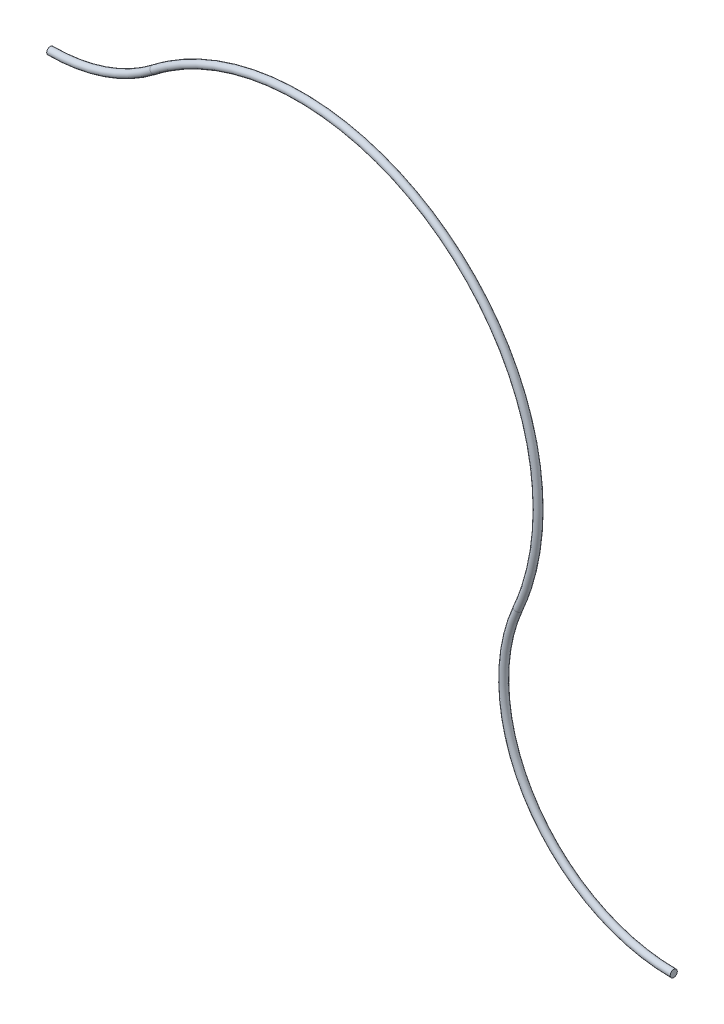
ISO-10303-21;
HEADER;
FILE_DESCRIPTION(('STEP AP214'),'2;1');
FILE_NAME('part.step','',(''),(''),'','','');
FILE_SCHEMA(('AUTOMOTIVE_DESIGN { 1 0 10303 214 1 1 1 1 }'));
ENDSEC;
DATA;
#1=APPLICATION_CONTEXT('core data for automotive mechanical design processes');
#2=APPLICATION_PROTOCOL_DEFINITION('international standard','automotive_design',2000,#1);
#3=PRODUCT_CONTEXT('',#1,'mechanical');
#4=PRODUCT('Part','Part','',(#3));
#5=PRODUCT_RELATED_PRODUCT_CATEGORY('part','',(#4));
#6=PRODUCT_DEFINITION_FORMATION('','',#4);
#7=PRODUCT_DEFINITION_CONTEXT('part definition',#1,'design');
#8=PRODUCT_DEFINITION('design','',#6,#7);
#9=PRODUCT_DEFINITION_SHAPE('','',#8);
#10=(LENGTH_UNIT() NAMED_UNIT(*) SI_UNIT(.MILLI.,.METRE.));
#11=(NAMED_UNIT(*) PLANE_ANGLE_UNIT() SI_UNIT($,.RADIAN.));
#12=(NAMED_UNIT(*) SI_UNIT($,.STERADIAN.) SOLID_ANGLE_UNIT());
#13=UNCERTAINTY_MEASURE_WITH_UNIT(LENGTH_MEASURE(1.E-05),#10,'distance_accuracy_value','');
#14=(GEOMETRIC_REPRESENTATION_CONTEXT(3) GLOBAL_UNCERTAINTY_ASSIGNED_CONTEXT((#13)) GLOBAL_UNIT_ASSIGNED_CONTEXT((#10,
#11,#12)) REPRESENTATION_CONTEXT('',''));
#15=CARTESIAN_POINT('',(0.,0.,0.));
#16=DIRECTION('',(0.,0.,1.));
#17=DIRECTION('',(1.,0.,0.));
#18=AXIS2_PLACEMENT_3D('',#15,#16,#17);
#19=CARTESIAN_POINT('',(2.794,-1.4224,0.));
#20=DIRECTION('',(0.,0.,1.));
#21=DIRECTION('',(1.,0.,0.));
#22=AXIS2_PLACEMENT_3D('',#19,#20,#21);
#23=TOROIDAL_SURFACE('',#22,0.762,0.015875);
#24=CARTESIAN_POINT('',(2.09616051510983,-1.1163541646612,0.));
#25=DIRECTION('',(-0.401634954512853,-0.915799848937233,0.));
#26=DIRECTION('',(0.,0.,-1.));
#27=AXIS2_PLACEMENT_3D('',#24,#25,#26);
#28=CIRCLE('',#27,0.015875);
#29=CARTESIAN_POINT('',(2.08162219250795,-1.10997820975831,0.));
#30=VERTEX_POINT('',#29);
#31=EDGE_CURVE('E37',#30,#30,#28,.T.);
#32=CARTESIAN_POINT('',(2.794,-2.1844,0.));
#33=DIRECTION('',(1.,0.,0.));
#34=DIRECTION('',(0.,0.,-1.));
#35=AXIS2_PLACEMENT_3D('',#32,#33,#34);
#36=CIRCLE('',#35,0.015875);
#37=CARTESIAN_POINT('',(2.794,-2.200275,0.));
#38=VERTEX_POINT('',#37);
#39=EDGE_CURVE('E10',#38,#38,#36,.T.);
#40=CARTESIAN_POINT('',(2.794,-1.4224,0.));
#41=DIRECTION('',(0.,0.,1.));
#42=DIRECTION('',(1.,0.,0.));
#43=AXIS2_PLACEMENT_3D('',#40,#41,#42);
#44=CIRCLE('',#43,0.777875);
#45=EDGE_CURVE('',#30,#38,#44,.T.);
#46=ORIENTED_EDGE('',*,*,#31,.T.);
#47=ORIENTED_EDGE('',*,*,#39,.F.);
#48=ORIENTED_EDGE('',*,*,#45,.T.);
#49=ORIENTED_EDGE('',*,*,#45,.F.);
#50=EDGE_LOOP('',(#46,#48,#47,#49));
#51=FACE_BOUND('',#50,.T.);
#52=ADVANCED_FACE('F31',(#51),#23,.T.);
#53=CARTESIAN_POINT('',(1.11781967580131,-0.687291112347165,0.));
#54=DIRECTION('',(0.,0.,-1.));
#55=DIRECTION('',(-1.,0.,0.));
#56=AXIS2_PLACEMENT_3D('',#53,#54,#55);
#57=TOROIDAL_SURFACE('',#56,1.06829111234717,0.015875);
#58=CARTESIAN_POINT('',(0.465378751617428,0.158620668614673,0.));
#59=DIRECTION('',(0.79183639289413,0.610733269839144,0.));
#60=DIRECTION('',(0.,0.,-1.));
#61=AXIS2_PLACEMENT_3D('',#58,#59,#60);
#62=CIRCLE('',#61,0.015875);
#63=CARTESIAN_POINT('',(0.475074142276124,0.146050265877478,0.));
#64=VERTEX_POINT('',#63);
#65=EDGE_CURVE('E41',#64,#64,#62,.T.);
#66=ORIENTED_EDGE('',*,*,#65,.T.);
#67=EDGE_LOOP('',(#66));
#68=FACE_BOUND('',#67,.T.);
#69=ORIENTED_EDGE('',*,*,#31,.F.);
#70=EDGE_LOOP('',(#69));
#71=FACE_BOUND('',#70,.T.);
#72=ADVANCED_FACE('F61',(#68,#71),#57,.T.);
#73=CARTESIAN_POINT('',(0.,0.762,0.));
#74=DIRECTION('',(0.,0.,-1.));
#75=DIRECTION('',(-1.,0.,0.));
#76=AXIS2_PLACEMENT_3D('',#73,#74,#75);
#77=TOROIDAL_SURFACE('',#76,0.762,0.015875);
#78=CARTESIAN_POINT('',(0.,0.,0.));
#79=DIRECTION('',(1.,0.,0.));
#80=DIRECTION('',(0.,0.,-1.));
#81=AXIS2_PLACEMENT_3D('',#78,#79,#80);
#82=CIRCLE('',#81,0.015875);
#83=CARTESIAN_POINT('',(0.,-0.0158750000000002,0.));
#84=VERTEX_POINT('',#83);
#85=EDGE_CURVE('E45',#84,#84,#82,.T.);
#86=CARTESIAN_POINT('',(0.,0.762,0.));
#87=DIRECTION('',(0.,0.,-1.));
#88=DIRECTION('',(-1.,0.,0.));
#89=AXIS2_PLACEMENT_3D('',#86,#87,#88);
#90=CIRCLE('',#89,0.777875);
#91=EDGE_CURVE('',#64,#84,#90,.T.);
#92=ORIENTED_EDGE('',*,*,#65,.F.);
#93=ORIENTED_EDGE('',*,*,#85,.T.);
#94=ORIENTED_EDGE('',*,*,#91,.T.);
#95=ORIENTED_EDGE('',*,*,#91,.F.);
#96=EDGE_LOOP('',(#92,#94,#93,#95));
#97=FACE_BOUND('',#96,.T.);
#98=ADVANCED_FACE('F51',(#97),#77,.T.);
#99=CARTESIAN_POINT('',(2.794,-2.1844,0.));
#100=DIRECTION('',(1.,0.,0.));
#101=DIRECTION('',(0.,0.,-1.));
#102=AXIS2_PLACEMENT_3D('',#99,#100,#101);
#103=PLANE('',#102);
#104=ORIENTED_EDGE('',*,*,#39,.T.);
#105=EDGE_LOOP('',(#104));
#106=FACE_BOUND('',#105,.T.);
#107=ADVANCED_FACE('F55',(#106),#103,.T.);
#108=CARTESIAN_POINT('',(0.,0.,0.));
#109=DIRECTION('',(1.,0.,0.));
#110=DIRECTION('',(0.,0.,-1.));
#111=AXIS2_PLACEMENT_3D('',#108,#109,#110);
#112=PLANE('',#111);
#113=ORIENTED_EDGE('',*,*,#85,.F.);
#114=EDGE_LOOP('',(#113));
#115=FACE_BOUND('',#114,.T.);
#116=ADVANCED_FACE('F53',(#115),#112,.F.);
#117=CLOSED_SHELL('',(#52,#72,#98,#107,#116));
#118=MANIFOLD_SOLID_BREP('B2',#117);
#119=ADVANCED_BREP_SHAPE_REPRESENTATION('',(#18,#118),#14);
#120=SHAPE_DEFINITION_REPRESENTATION(#9,#119);
ENDSEC;
END-ISO-10303-21;
